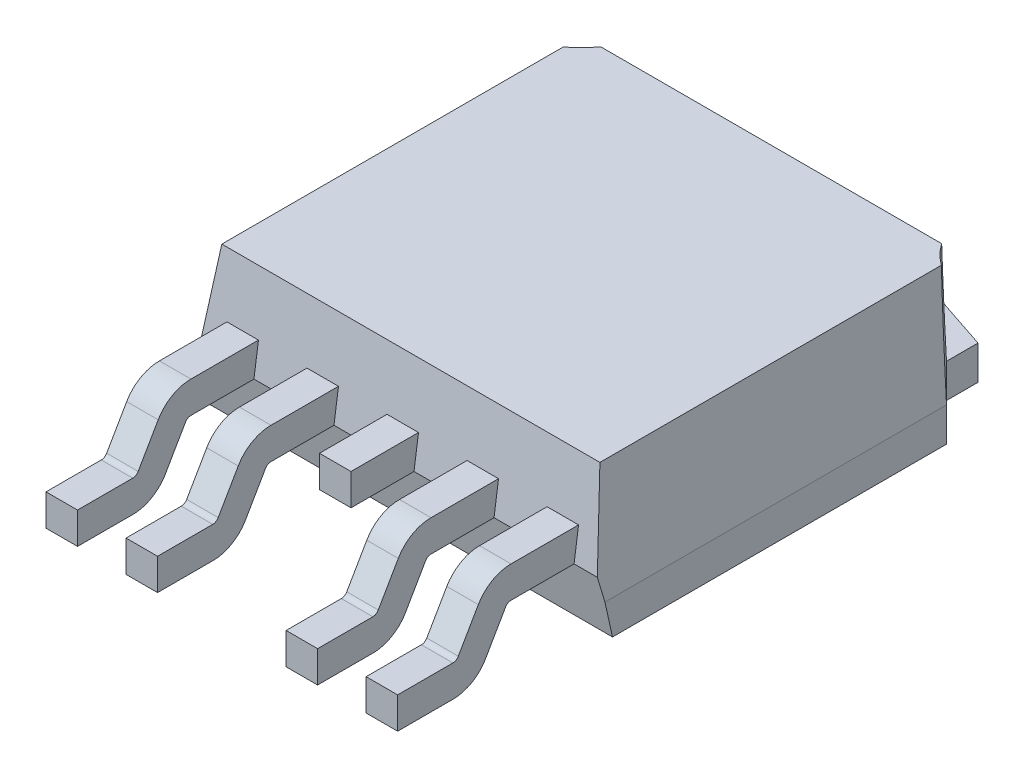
from build123d import *

# Parameters (mm, degrees)
BOSS_EXTRUDE1_DEPTH = 0.54
BOSS_EXTRUDE3_DEPTH = 2.3
CUT_EXTRUDE1_DEPTH  = 0.05
CUT_EXTRUDE2_DEPTH  = 7
CUT_EXTRUDE3_DEPTH  = 7
CUT_EXTRUDE4_DEPTH  = 7
BOSS_EXTRUDE4_DEPTH = 0.5
LPATTERN1_COUNT     = 2
LPATTERN1_PITCH     = 1.27
LPATTERN2_COUNT     = 2
LPATTERN2_PITCH     = 3.81
LPATTERN3_COUNT     = 2
LPATTERN3_PITCH     = 5.08
BOSS_EXTRUDE5_DEPTH = 0.5


with BuildPart() as part:
    # Sketch1 → Boss-Extrude1 (new body)
    with BuildSketch(Plane(origin=(0, 0, 0), x_dir=(1, 0, 0), z_dir=(0, 1, 0))):
        Polygon((0.65, 5.1), (-0.25, 4.8), (-0.25, 3.8), (0, 3.8), (0, 0), (4.7, 0), (4.7, 3.8), (4.95, 3.8), (4.95, 4.8), (4.05, 5.1), (3.15, 5.1), (3.15, 4.7), (1.55, 4.7), (1.55, 5.1), align=None)
        with BuildLine():
            Line((1.55, 3.9), (3.15, 3.9))
            ThreePointArc((3.15, 3.9), (3.45, 3.6), (3.15, 3.3))
            Line((3.15, 3.3), (1.55, 3.3))
            ThreePointArc((1.55, 3.3), (1.25, 3.6), (1.55, 3.9))
        make_face(mode=Mode.SUBTRACT)
    extrude(amount=BOSS_EXTRUDE1_DEPTH)


with BuildPart() as body_2:
    # Sketch2 → Boss-Extrude3 (new body)
    with BuildSketch(Plane(origin=(0, 0, 0), x_dir=(1, 0, 0), z_dir=(0, 1, 0))):
        with BuildLine():
            Line((-0.25, 4.3), (4.95, 4.3))
            ThreePointArc((4.95, 4.3), (5.197990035, 3.947990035), (5.55, 3.7))
            Line((5.55, 3.7), (5.55, -1.8))
            Line((5.55, -1.8), (-0.85, -1.8))
            Line((-0.85, -1.8), (-0.85, 3.7))
            ThreePointArc((-0.85, 3.7), (-0.497990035, 3.947990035), (-0.25, 4.3))
        make_face()
    extrude(amount=BOSS_EXTRUDE3_DEPTH)

    # Sketch3 → Cut-Extrude1 (cut)
    with BuildSketch(Plane(origin=(0, 0, 0), x_dir=(1, 0, 0), z_dir=(0, 1, 0))):
        Polygon((0, 3.8), (0, 0), (4.7, 0), (4.7, 3.8), (4.95, 3.8), (4.95, 4.3), (-0.25, 4.3), (-0.25, 3.8), align=None)
        with BuildLine():
            Line((3.15, 3.9), (1.55, 3.9))
            ThreePointArc((1.55, 3.9), (1.25, 3.6), (1.55, 3.3))
            Line((1.55, 3.3), (3.15, 3.3))
            ThreePointArc((3.15, 3.3), (3.45, 3.6), (3.15, 3.9))
        make_face(mode=Mode.SUBTRACT)
    extrude(amount=CUT_EXTRUDE1_DEPTH, mode=Mode.SUBTRACT)

    # Sketch6 → Cut-Extrude2 (cut)
    with BuildSketch(Plane(origin=(5.55, 0, 0), x_dir=(0, 0, -1), z_dir=(1, 0, 0))):
        Polygon((4.1, 2.473096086), (4.3, 0.54), (4.3, 2.473096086), align=None)
        Polygon((-1.8, 0.9), (-1.8, 2.3), (-1.6, 2.3), align=None)
    extrude(amount=-CUT_EXTRUDE2_DEPTH, mode=Mode.SUBTRACT)

    # Sketch7 → Cut-Extrude3 (cut)
    with BuildSketch(Plane(origin=(0, 0, -4.3), x_dir=(-1, 0, 0), z_dir=(0, 0, -1))):
        Polygon((-5.35, 2.3), (-5.55, 2.3), (-5.55, 0.54), align=None)
        Polygon((0.65, 2.3), (0.85, 2.3), (0.85, 0.54), align=None)
    extrude(amount=-CUT_EXTRUDE3_DEPTH, mode=Mode.SUBTRACT)

    # Sketch9 → Cut-Extrude4 (cut)
    with BuildSketch(Plane(origin=(5.55, 0, 0), x_dir=(0, 0, -1), z_dir=(1, 0, 0))):
        Polygon((-1.8, 0), (-1.8, 0.9), (-1.6, 0), align=None)
    extrude(amount=-CUT_EXTRUDE4_DEPTH, mode=Mode.SUBTRACT)

    # Sketch10 → Boss-Extrude4 (add)
    with BuildSketch(Plane(origin=(-0.44, 0, 0), x_dir=(0, 0, -1), z_dir=(1, 0, 0))):
        with BuildLine():
            Line((-1.8, 0.9), (-2.8, 0.9))
            ThreePointArc((-2.8, 0.9), (-2.850001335, 0.886602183), (-2.886604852, 0.849998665))
            Line((-2.886604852, 0.849998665), (-3.216027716, 0.279421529))
            ThreePointArc((-3.216027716, 0.279421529), (-3.423526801, 0.07997743), (-3.7, 0))
            Line((-3.7, 0), (-4.6, 0))
            Line((-4.6, 0), (-4.6, 0.5))
            Line((-4.6, 0.5), (-3.723761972, 0.5))
            ThreePointArc((-3.723761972, 0.5), (-3.673761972, 0.51339746), (-3.637159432, 0.55))
            Line((-3.637159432, 0.55), (-3.319617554, 1.099998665))
            ThreePointArc((-3.319617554, 1.099998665), (-3.100001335, 1.319614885), (-2.8, 1.4))
            Line((-2.8, 1.4), (-1.588904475, 1.4))
            Line((-1.588904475, 1.4), (-1.588904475, 0.9))
            Line((-1.588904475, 0.9), (-1.8, 0.9))
        make_face()
    boss_extrude4 = extrude(amount=BOSS_EXTRUDE4_DEPTH)

    # LPattern1: Boss-Extrude4 ×2
    with Locations(*[(i * LPATTERN1_PITCH, 0, 0) for i in range(1, LPATTERN1_COUNT)]):
        add(boss_extrude4)

    # LPattern2: Boss-Extrude4 ×2
    with Locations(*[(i * LPATTERN2_PITCH, 0, 0) for i in range(1, LPATTERN2_COUNT)]):
        add(boss_extrude4)

    # LPattern3: Boss-Extrude4 ×2
    with Locations(*[(i * LPATTERN3_PITCH, 0, 0) for i in range(1, LPATTERN3_COUNT)]):
        add(boss_extrude4)

    # Sketch11 → Boss-Extrude5 (add)
    with BuildSketch(Plane(origin=(2.1, 0, 0), x_dir=(0, 0, -1), z_dir=(1, 0, 0))):
        Polygon((-2.8, 0.9), (-2.8, 1.4), (-1.728571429, 1.4), (-1.8, 0.9), align=None)
    extrude(amount=BOSS_EXTRUDE5_DEPTH)


solid = Compound([part.part, body_2.part])
